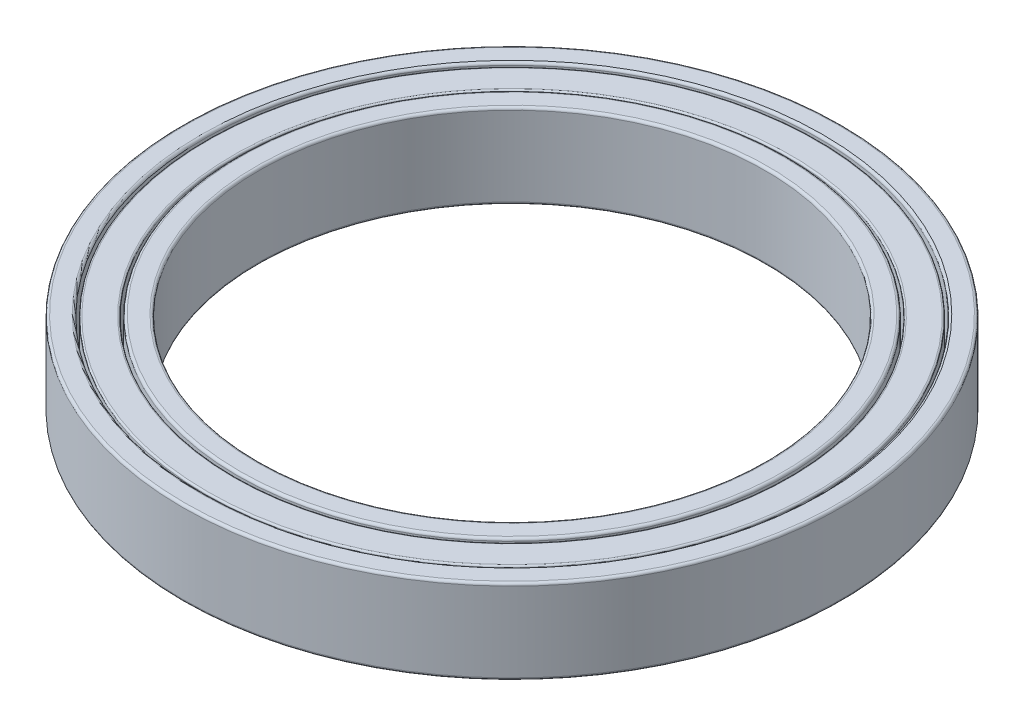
from build123d import *

# Parameters (mm, degrees)
SKETCH1_R           = 32.5
SKETCH1_R_2         = 30
BOSS_EXTRUDE1_DEPTH = 10
SKETCH2_R           = 39
SKETCH2_R_2         = 36.5
BOSS_EXTRUDE2_DEPTH = 10
BOSS_EXTRUDE3_START = -0.2
SKETCH3_R           = 36.2
SKETCH3_R_2         = 32.8
BOSS_EXTRUDE3_DEPTH = 9.6
FILLET1_R           = 0.3
FILLET2_R           = 0.3
FILLET3_R           = 0.2


with BuildPart() as part:
    # Sketch1 → Boss-Extrude1 (new body)
    with BuildSketch(Plane(origin=(0, 0, 0), x_dir=(1, 0, 0), z_dir=(0, 1, 0))):
        with Locations(Location((0, 0, 0), (0, 0, 270))):
            Circle(SKETCH1_R)
        with Locations(Location((0, 0, 0), (0, 0, 270))):
            Circle(SKETCH1_R_2, mode=Mode.SUBTRACT)
    extrude(amount=BOSS_EXTRUDE1_DEPTH)

    # Fillet2
    fillet2_edges = [part.edges().sort_by_distance(p)[0] for p in [
        (0, 0, -32.5),
        (0, 10, -32.5),
        (0, 0, -30),
        (0, 10, -30),
    ]]
    fillet(fillet2_edges, radius=FILLET2_R)


with BuildPart() as body_2:
    # Sketch2 → Boss-Extrude2 (new body)
    with BuildSketch(Plane(origin=(0, 0, 0), x_dir=(1, 0, 0), z_dir=(0, 1, 0))):
        with Locations(Location((0, 0, 0), (0, 0, 270))):
            Circle(SKETCH2_R)
        with Locations(Location((0, 0, 0), (0, 0, 270))):
            Circle(SKETCH2_R_2, mode=Mode.SUBTRACT)
    extrude(amount=BOSS_EXTRUDE2_DEPTH)

    # Fillet1
    fillet1_edges = [body_2.edges().sort_by_distance(p)[0] for p in [
        (0, 10, -39),
        (0, 0, -39),
        (0, 0, -36.5),
        (0, 10, -36.5),
    ]]
    fillet(fillet1_edges, radius=FILLET1_R)


with BuildPart() as body_3:
    # Sketch3 → Boss-Extrude3 (new body)
    with BuildSketch(Plane(origin=(0, 10, 0), x_dir=(1, 0, 0), z_dir=(0, 1, 0)).offset(BOSS_EXTRUDE3_START)):
        with Locations(Location((0, 0, 0), (0, 0, 270))):
            Circle(SKETCH3_R)
        with Locations(Location((0, 0, 0), (0, 0, 270))):
            Circle(SKETCH3_R_2, mode=Mode.SUBTRACT)
    extrude(amount=-BOSS_EXTRUDE3_DEPTH)

    # Fillet3
    fillet3_edges = [body_3.edges().sort_by_distance(p)[0] for p in [
        (0, 9.8, -36.2),
        (0, 9.8, -32.8),
        (0, 0.2, -36.2),
        (0, 0.2, -32.8),
    ]]
    fillet(fillet3_edges, radius=FILLET3_R)


solid = Compound([part.part, body_2.part, body_3.part])
